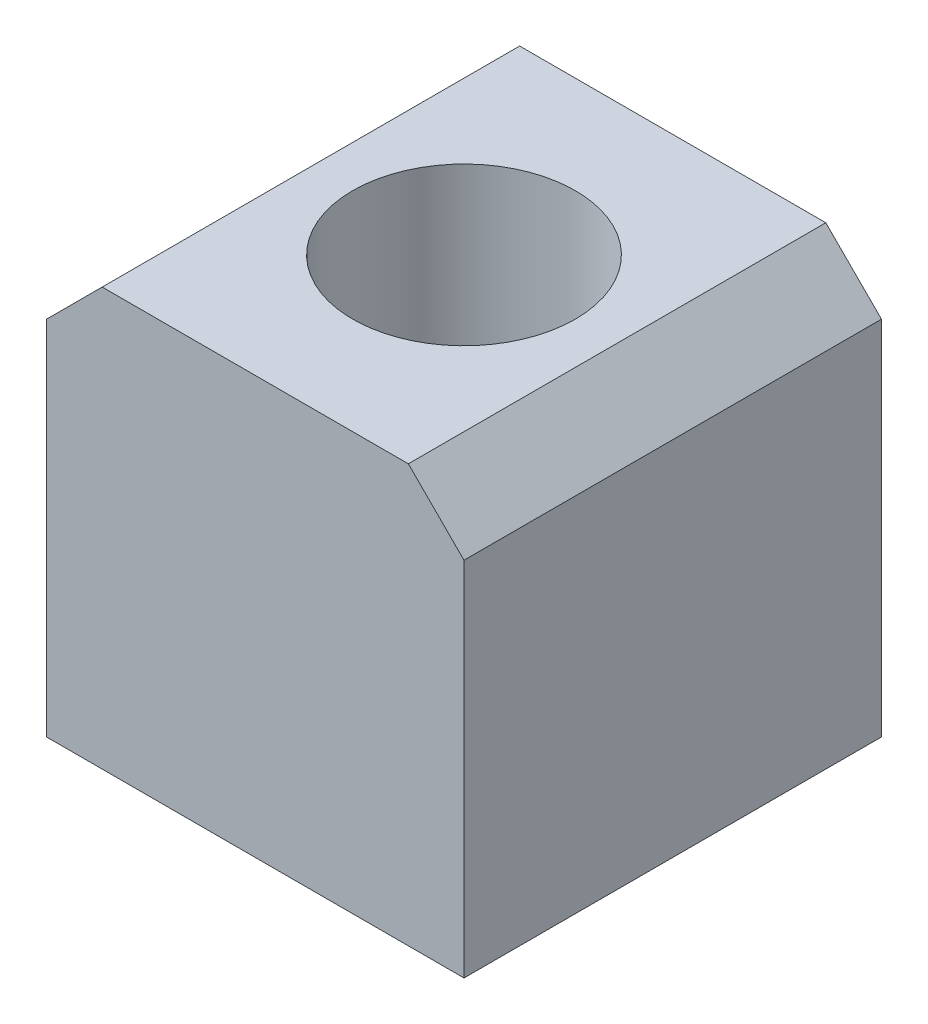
from build123d import *

# Parameters (mm, degrees)
BOSS_EXTRU_1_DEPTH      = 7.5
BOSS_EXTRU_1_DEPTH_BACK = 7.5
ESQUISSE1_W             = 15
ESQUISSE1_H             = 15
CHANFREIN1_SIZE         = 2
ESQUISSE2_R             = 4
ENL_V_MAT_EXTRU_1_DEPTH = 22.5


with BuildPart() as part:
    # Esquisse1 → Boss.-Extru.1 (new, two sides: drawn at the far end of the back side and taken through both)
    with BuildSketch(Plane.XY.offset(-BOSS_EXTRU_1_DEPTH_BACK)):
        Rectangle(ESQUISSE1_W, ESQUISSE1_H)
    extrude(amount=BOSS_EXTRU_1_DEPTH + BOSS_EXTRU_1_DEPTH_BACK)

    # Chanfrein1
    chanfrein1_edges = [part.edges().sort_by_distance(p)[0] for p in [
        (-7.5, 7.5, 0),
        (7.5, 7.5, 0),
    ]]
    chamfer(chanfrein1_edges, length=CHANFREIN1_SIZE)

    # Esquisse2 → Enl_v. mat.-Extru.1 (cut)
    with BuildSketch(Plane(origin=(0, 7.5, 0), x_dir=(1, 0, 0), z_dir=(0, 1, 0))):
        with Locations(Location((0, 0, 0), (0, 0, 180))):
            Circle(ESQUISSE2_R)
    extrude(amount=-ENL_V_MAT_EXTRU_1_DEPTH, mode=Mode.SUBTRACT)


solid = part.part
